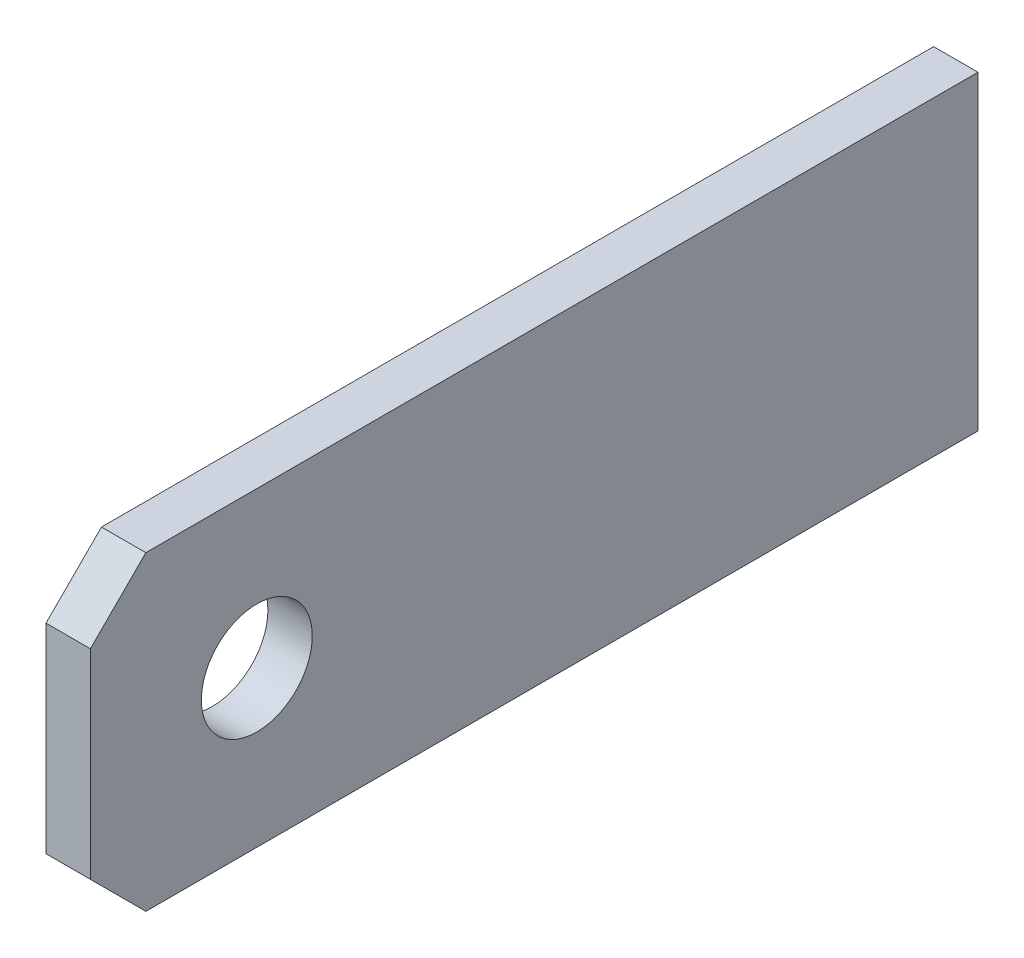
from build123d import *

# Parameters (mm, degrees)
ESQUISSE1_W             = 0.4
ESQUISSE1_H             = 2.8
BASE_EXTRUSION_DEPTH    = 8
CHANFREIN1_SIZE         = 0.5
ESQUISSE2_R             = 0.5
ENL_V_MAT_EXTRU_1_DEPTH = 9.13142054


with BuildPart() as part:
    # Esquisse1 → Base-Extrusion (new body)
    with BuildSketch(Plane.XY):
        with Locations((-11.5, 0)):
            Rectangle(ESQUISSE1_W, ESQUISSE1_H)
    extrude(amount=BASE_EXTRUSION_DEPTH)

    # Chanfrein1
    chanfrein1_edges = [part.edges().sort_by_distance(p)[0] for p in [
        (-11.5, -1.4, 8),
        (-11.5, 1.4, 8),
    ]]
    chamfer(chanfrein1_edges, length=CHANFREIN1_SIZE)

    # Esquisse2 → Enl_v. mat.-Extru.1 (cut, through all)
    with BuildSketch(Plane.ZY.offset(11.7)):
        with Locations(Location((6.5, 0, 0), (0, 0, 270))):
            Circle(ESQUISSE2_R)
    extrude(amount=-ENL_V_MAT_EXTRU_1_DEPTH, mode=Mode.SUBTRACT)


solid = part.part
